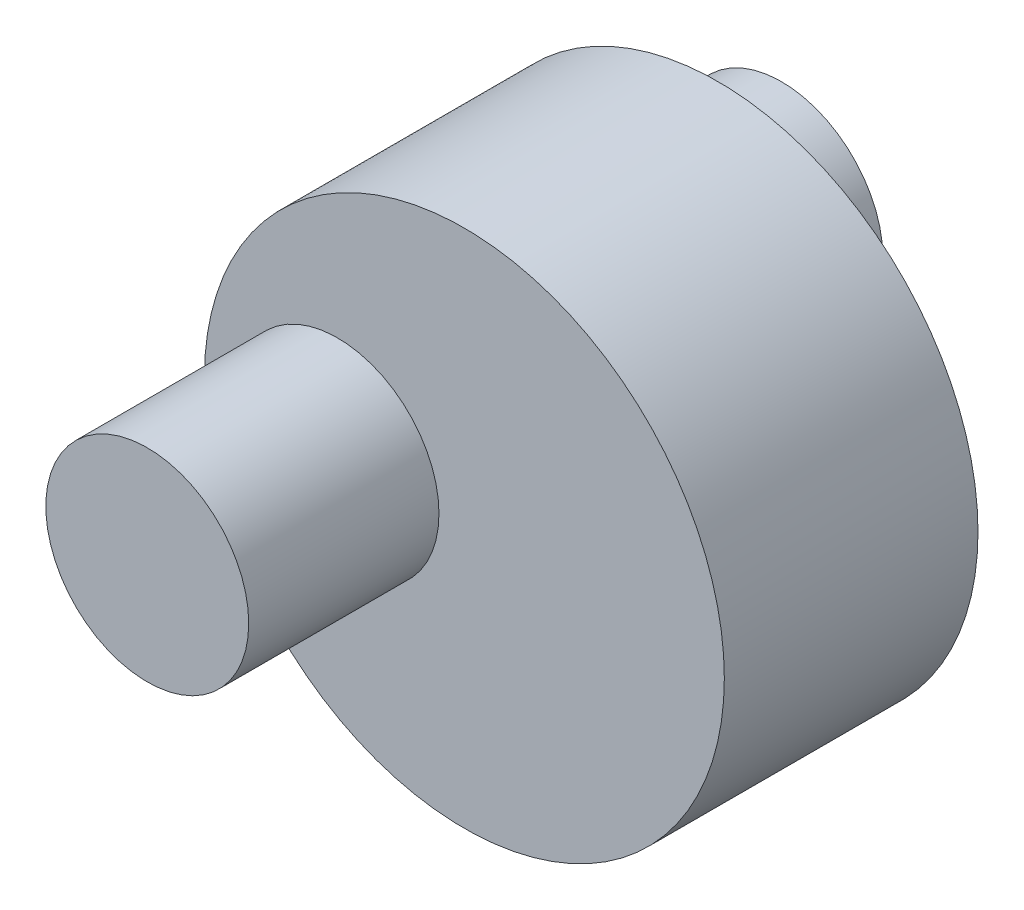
from build123d import *

# Parameters (mm, degrees)
ESQUISSE1_R          = 8
BASE_EXTRUSION_DEPTH = 25
ESQUISSE2_R          = 20.5
BOSS_EXTRU_1_DEPTH   = 10


with BuildPart() as part:
    # Esquisse1 → Base-Extrusion (new, symmetric)
    with BuildSketch(Plane.XY):
        Circle(ESQUISSE1_R)
    extrude(amount=BASE_EXTRUSION_DEPTH, both=True)

    # Esquisse2 → Boss.-Extru.1 (add, symmetric)
    with BuildSketch(Plane.XY):
        with Locations((10, 0)):
            Circle(ESQUISSE2_R)
    extrude(amount=BOSS_EXTRU_1_DEPTH, both=True)


solid = part.part
